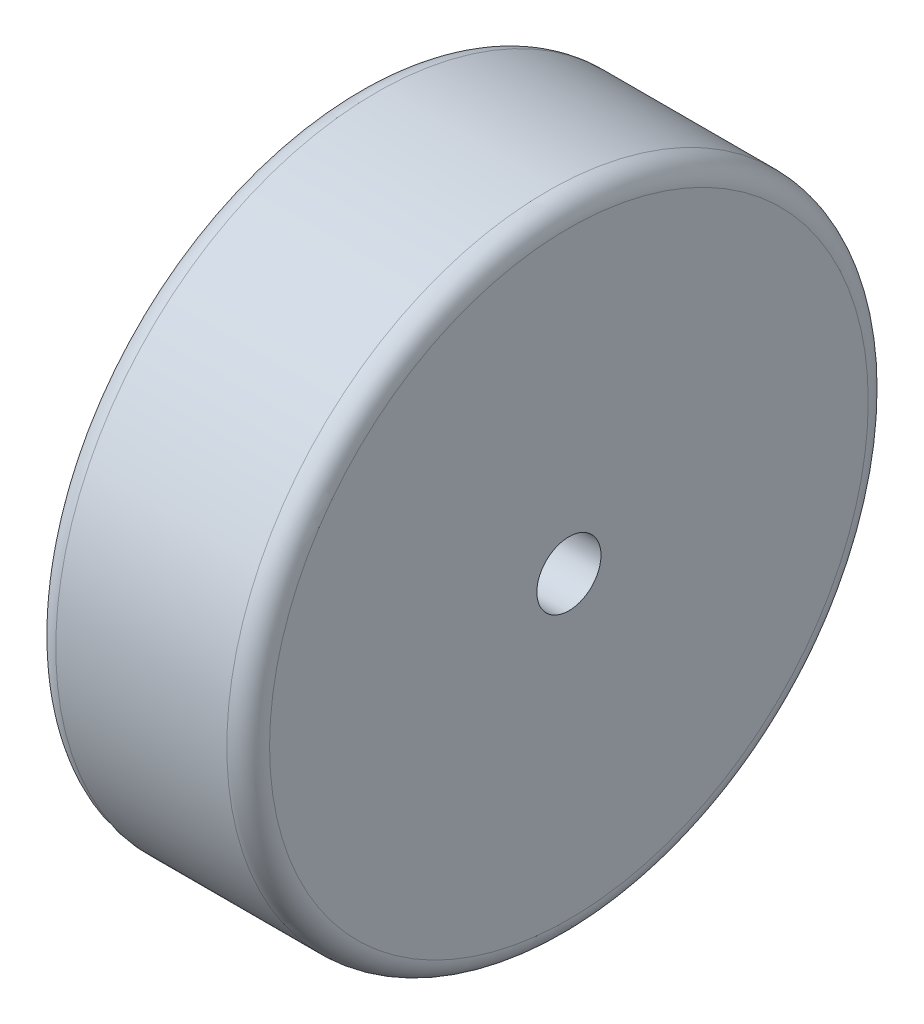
from build123d import *


with BuildPart() as part:
    # Skizze1 → Rotation1 (revolve)
    with BuildSketch(Plane.XY, mode=Mode.PRIVATE) as rotation1_sk:
        with BuildLine():
            Line((-40, 300), (40, 300))
            ThreePointArc((40, 300), (47.071067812, 297.071067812), (50, 290))
            Line((50, 290), (50, 165))
            Line((50, 165), (-50, 165))
            Line((-50, 165), (-50, 290))
            ThreePointArc((-50, 290), (-47.071067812, 297.071067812), (-40, 300))
        make_face()
    revolve(rotation1_sk.sketch.rotate(Axis((0, 150, 0), (-1, 0, 0)), 90), axis=Axis((0, 150, 0), (-1, 0, 0)))


solid = part.part
